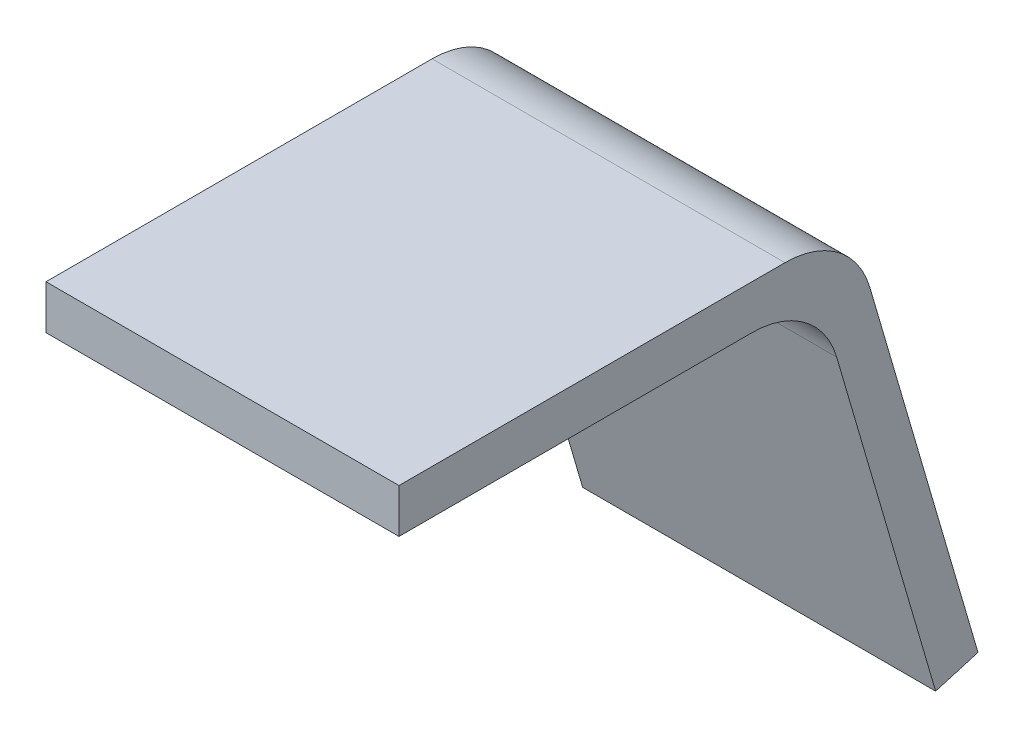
ISO-10303-21;
HEADER;
FILE_DESCRIPTION(('STEP AP214'),'2;1');
FILE_NAME('part.step','',(''),(''),'','','');
FILE_SCHEMA(('AUTOMOTIVE_DESIGN { 1 0 10303 214 1 1 1 1 }'));
ENDSEC;
DATA;
#1=APPLICATION_CONTEXT('core data for automotive mechanical design processes');
#2=APPLICATION_PROTOCOL_DEFINITION('international standard','automotive_design',2000,#1);
#3=PRODUCT_CONTEXT('',#1,'mechanical');
#4=PRODUCT('Part','Part','',(#3));
#5=PRODUCT_RELATED_PRODUCT_CATEGORY('part','',(#4));
#6=PRODUCT_DEFINITION_FORMATION('','',#4);
#7=PRODUCT_DEFINITION_CONTEXT('part definition',#1,'design');
#8=PRODUCT_DEFINITION('design','',#6,#7);
#9=PRODUCT_DEFINITION_SHAPE('','',#8);
#10=(LENGTH_UNIT() NAMED_UNIT(*) SI_UNIT(.MILLI.,.METRE.));
#11=(NAMED_UNIT(*) PLANE_ANGLE_UNIT() SI_UNIT($,.RADIAN.));
#12=(NAMED_UNIT(*) SI_UNIT($,.STERADIAN.) SOLID_ANGLE_UNIT());
#13=UNCERTAINTY_MEASURE_WITH_UNIT(LENGTH_MEASURE(1.E-05),#10,'distance_accuracy_value','');
#14=(GEOMETRIC_REPRESENTATION_CONTEXT(3) GLOBAL_UNCERTAINTY_ASSIGNED_CONTEXT((#13)) GLOBAL_UNIT_ASSIGNED_CONTEXT((#10,
#11,#12)) REPRESENTATION_CONTEXT('',''));
#15=CARTESIAN_POINT('',(0.,0.,0.));
#16=DIRECTION('',(0.,0.,1.));
#17=DIRECTION('',(1.,0.,0.));
#18=AXIS2_PLACEMENT_3D('',#15,#16,#17);
#19=CARTESIAN_POINT('',(-12.7,239.737732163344,356.042138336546));
#20=DIRECTION('',(1.,0.,0.));
#21=DIRECTION('',(0.,1.,0.));
#22=AXIS2_PLACEMENT_3D('',#19,#20,#21);
#23=PLANE('',#22);
#24=DIRECTION('',(0.,0.959872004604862,0.28043846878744));
#25=VECTOR('',#24,1.);
#26=CARTESIAN_POINT('',(-12.7,296.428648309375,262.583586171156));
#27=LINE('',#26,#25);
#28=CARTESIAN_POINT('',(-12.7,284.238273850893,259.022017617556));
#29=VERTEX_POINT('',#28);
#30=CARTESIAN_POINT('',(-12.7,308.619022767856,266.145154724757));
#31=VERTEX_POINT('',#30);
#32=EDGE_CURVE('E137',#29,#31,#27,.T.);
#33=ORIENTED_EDGE('',*,*,#32,.T.);
#34=CARTESIAN_POINT('',(-12.7,306.838238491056,272.240341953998));
#35=DIRECTION('',(1.,0.,0.));
#36=DIRECTION('',(0.,0.,-1.));
#37=AXIS2_PLACEMENT_3D('',#34,#35,#36);
#38=CIRCLE('',#37,6.35000000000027);
#39=CARTESIAN_POINT('',(-12.7,313.188238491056,272.240341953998));
#40=VERTEX_POINT('',#39);
#41=EDGE_CURVE('E27',#31,#40,#38,.T.);
#42=ORIENTED_EDGE('',*,*,#41,.T.);
#43=DIRECTION('',(0.,0.,1.));
#44=VECTOR('',#43,1.);
#45=CARTESIAN_POINT('',(-12.7,313.188238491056,284.940341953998));
#46=LINE('',#45,#44);
#47=CARTESIAN_POINT('',(-12.7,313.188238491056,297.640341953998));
#48=VERTEX_POINT('',#47);
#49=EDGE_CURVE('E118',#40,#48,#46,.T.);
#50=ORIENTED_EDGE('',*,*,#49,.T.);
#51=DIRECTION('',(0.,1.,0.));
#52=VECTOR('',#51,1.);
#53=CARTESIAN_POINT('',(-12.7,314.775738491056,297.640341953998));
#54=LINE('',#53,#52);
#55=CARTESIAN_POINT('',(-12.7,316.363238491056,297.640341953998));
#56=VERTEX_POINT('',#55);
#57=EDGE_CURVE('E121',#48,#56,#54,.T.);
#58=ORIENTED_EDGE('',*,*,#57,.T.);
#59=DIRECTION('',(0.,0.,-1.));
#60=VECTOR('',#59,1.);
#61=CARTESIAN_POINT('',(-12.7,316.363238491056,283.75028335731));
#62=LINE('',#61,#60);
#63=CARTESIAN_POINT('',(-12.7,316.363238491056,269.860224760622));
#64=VERTEX_POINT('',#63);
#65=EDGE_CURVE('E254',#56,#64,#62,.T.);
#66=ORIENTED_EDGE('',*,*,#65,.T.);
#67=CARTESIAN_POINT('',(-12.7,310.013238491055,269.860224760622));
#68=DIRECTION('',(1.,0.,0.));
#69=DIRECTION('',(0.,0.,-1.));
#70=AXIS2_PLACEMENT_3D('',#67,#68,#69);
#71=CIRCLE('',#70,6.35000000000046);
#72=CARTESIAN_POINT('',(-12.7,311.794022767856,263.765037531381));
#73=VERTEX_POINT('',#72);
#74=EDGE_CURVE('E266',#73,#64,#71,.T.);
#75=ORIENTED_EDGE('',*,*,#74,.F.);
#76=DIRECTION('',(0.,-0.959872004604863,-0.280438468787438));
#77=VECTOR('',#76,1.);
#78=CARTESIAN_POINT('',(-12.7,298.461344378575,259.869730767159));
#79=LINE('',#78,#77);
#80=CARTESIAN_POINT('',(-12.7,285.128665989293,255.974424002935));
#81=VERTEX_POINT('',#80);
#82=EDGE_CURVE('E275',#73,#81,#79,.T.);
#83=ORIENTED_EDGE('',*,*,#82,.T.);
#84=DIRECTION('',(0.,-0.280438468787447,0.95987200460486));
#85=VECTOR('',#84,1.);
#86=CARTESIAN_POINT('',(-12.7,284.683469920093,257.498220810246));
#87=LINE('',#86,#85);
#88=EDGE_CURVE('E252',#81,#29,#87,.T.);
#89=ORIENTED_EDGE('',*,*,#88,.T.);
#90=EDGE_LOOP('',(#33,#42,#50,#58,#66,#75,#83,#89));
#91=FACE_BOUND('',#90,.T.);
#92=ADVANCED_FACE('F17',(#91),#23,.F.);
#93=CARTESIAN_POINT('',(12.7,239.737732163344,356.042138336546));
#94=DIRECTION('',(1.,0.,0.));
#95=DIRECTION('',(0.,1.,0.));
#96=AXIS2_PLACEMENT_3D('',#93,#94,#95);
#97=PLANE('',#96);
#98=DIRECTION('',(0.,0.959872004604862,0.28043846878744));
#99=VECTOR('',#98,1.);
#100=CARTESIAN_POINT('',(12.7,296.428648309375,262.583586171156));
#101=LINE('',#100,#99);
#102=CARTESIAN_POINT('',(12.7,284.238273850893,259.022017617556));
#103=VERTEX_POINT('',#102);
#104=CARTESIAN_POINT('',(12.7,308.619022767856,266.145154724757));
#105=VERTEX_POINT('',#104);
#106=EDGE_CURVE('E246',#103,#105,#101,.T.);
#107=ORIENTED_EDGE('',*,*,#106,.F.);
#108=DIRECTION('',(0.,-0.280438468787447,0.95987200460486));
#109=VECTOR('',#108,1.);
#110=CARTESIAN_POINT('',(12.7,284.683469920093,257.498220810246));
#111=LINE('',#110,#109);
#112=CARTESIAN_POINT('',(12.7,285.128665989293,255.974424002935));
#113=VERTEX_POINT('',#112);
#114=EDGE_CURVE('E251',#113,#103,#111,.T.);
#115=ORIENTED_EDGE('',*,*,#114,.F.);
#116=DIRECTION('',(0.,-0.959872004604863,-0.280438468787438));
#117=VECTOR('',#116,1.);
#118=CARTESIAN_POINT('',(12.7,298.461344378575,259.869730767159));
#119=LINE('',#118,#117);
#120=CARTESIAN_POINT('',(12.7,311.794022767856,263.765037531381));
#121=VERTEX_POINT('',#120);
#122=EDGE_CURVE('E270',#121,#113,#119,.T.);
#123=ORIENTED_EDGE('',*,*,#122,.F.);
#124=CARTESIAN_POINT('',(12.7,310.013238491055,269.860224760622));
#125=DIRECTION('',(1.,0.,0.));
#126=DIRECTION('',(0.,0.,-1.));
#127=AXIS2_PLACEMENT_3D('',#124,#125,#126);
#128=CIRCLE('',#127,6.35000000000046);
#129=CARTESIAN_POINT('',(12.7,316.363238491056,269.860224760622));
#130=VERTEX_POINT('',#129);
#131=EDGE_CURVE('E258',#121,#130,#128,.T.);
#132=ORIENTED_EDGE('',*,*,#131,.T.);
#133=DIRECTION('',(0.,0.,-1.));
#134=VECTOR('',#133,1.);
#135=CARTESIAN_POINT('',(12.7,316.363238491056,283.75028335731));
#136=LINE('',#135,#134);
#137=CARTESIAN_POINT('',(12.7,316.363238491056,297.640341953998));
#138=VERTEX_POINT('',#137);
#139=EDGE_CURVE('E113',#138,#130,#136,.T.);
#140=ORIENTED_EDGE('',*,*,#139,.F.);
#141=DIRECTION('',(0.,1.,0.));
#142=VECTOR('',#141,1.);
#143=CARTESIAN_POINT('',(12.7,314.775738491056,297.640341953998));
#144=LINE('',#143,#142);
#145=CARTESIAN_POINT('',(12.7,313.188238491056,297.640341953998));
#146=VERTEX_POINT('',#145);
#147=EDGE_CURVE('E110',#146,#138,#144,.T.);
#148=ORIENTED_EDGE('',*,*,#147,.F.);
#149=DIRECTION('',(0.,0.,1.));
#150=VECTOR('',#149,1.);
#151=CARTESIAN_POINT('',(12.7,313.188238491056,284.940341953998));
#152=LINE('',#151,#150);
#153=CARTESIAN_POINT('',(12.7,313.188238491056,272.240341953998));
#154=VERTEX_POINT('',#153);
#155=EDGE_CURVE('E98',#154,#146,#152,.T.);
#156=ORIENTED_EDGE('',*,*,#155,.F.);
#157=CARTESIAN_POINT('',(12.7,306.838238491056,272.240341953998));
#158=DIRECTION('',(1.,0.,0.));
#159=DIRECTION('',(0.,0.,-1.));
#160=AXIS2_PLACEMENT_3D('',#157,#158,#159);
#161=CIRCLE('',#160,6.35000000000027);
#162=EDGE_CURVE('E11',#105,#154,#161,.T.);
#163=ORIENTED_EDGE('',*,*,#162,.F.);
#164=EDGE_LOOP('',(#107,#115,#123,#132,#140,#148,#156,#163));
#165=FACE_BOUND('',#164,.T.);
#166=ADVANCED_FACE('F19',(#165),#97,.T.);
#167=CARTESIAN_POINT('',(12.7,306.838238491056,272.240341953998));
#168=DIRECTION('',(-1.,0.,0.));
#169=DIRECTION('',(0.,0.,1.));
#170=AXIS2_PLACEMENT_3D('',#167,#168,#169);
#171=CYLINDRICAL_SURFACE('',#170,6.35000000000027);
#172=ORIENTED_EDGE('',*,*,#41,.F.);
#173=DIRECTION('',(-1.,0.,0.));
#174=VECTOR('',#173,1.);
#175=CARTESIAN_POINT('',(12.7,308.619022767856,266.145154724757));
#176=LINE('',#175,#174);
#177=EDGE_CURVE('E240',#105,#31,#176,.T.);
#178=ORIENTED_EDGE('',*,*,#177,.F.);
#179=ORIENTED_EDGE('',*,*,#162,.T.);
#180=DIRECTION('',(-1.,0.,0.));
#181=VECTOR('',#180,1.);
#182=CARTESIAN_POINT('',(12.7,313.188238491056,272.240341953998));
#183=LINE('',#182,#181);
#184=EDGE_CURVE('E105',#154,#40,#183,.T.);
#185=ORIENTED_EDGE('',*,*,#184,.T.);
#186=EDGE_LOOP('',(#172,#178,#179,#185));
#187=FACE_BOUND('',#186,.T.);
#188=ADVANCED_FACE('F139',(#187),#171,.F.);
#189=CARTESIAN_POINT('',(12.7,313.188238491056,284.940341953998));
#190=DIRECTION('',(0.,-1.,0.));
#191=DIRECTION('',(0.,0.,-1.));
#192=AXIS2_PLACEMENT_3D('',#189,#190,#191);
#193=PLANE('',#192);
#194=ORIENTED_EDGE('',*,*,#49,.F.);
#195=ORIENTED_EDGE('',*,*,#184,.F.);
#196=ORIENTED_EDGE('',*,*,#155,.T.);
#197=DIRECTION('',(-1.,0.,0.));
#198=VECTOR('',#197,1.);
#199=CARTESIAN_POINT('',(12.7,313.188238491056,297.640341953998));
#200=LINE('',#199,#198);
#201=EDGE_CURVE('E103',#146,#48,#200,.T.);
#202=ORIENTED_EDGE('',*,*,#201,.T.);
#203=EDGE_LOOP('',(#194,#195,#196,#202));
#204=FACE_BOUND('',#203,.T.);
#205=ADVANCED_FACE('F101',(#204),#193,.T.);
#206=CARTESIAN_POINT('',(12.7,314.775738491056,297.640341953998));
#207=DIRECTION('',(0.,0.,1.));
#208=DIRECTION('',(1.,0.,0.));
#209=AXIS2_PLACEMENT_3D('',#206,#207,#208);
#210=PLANE('',#209);
#211=ORIENTED_EDGE('',*,*,#57,.F.);
#212=ORIENTED_EDGE('',*,*,#201,.F.);
#213=ORIENTED_EDGE('',*,*,#147,.T.);
#214=DIRECTION('',(-1.,0.,0.));
#215=VECTOR('',#214,1.);
#216=CARTESIAN_POINT('',(12.7,316.363238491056,297.640341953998));
#217=LINE('',#216,#215);
#218=EDGE_CURVE('E257',#138,#56,#217,.T.);
#219=ORIENTED_EDGE('',*,*,#218,.T.);
#220=EDGE_LOOP('',(#211,#212,#213,#219));
#221=FACE_BOUND('',#220,.T.);
#222=ADVANCED_FACE('F120',(#221),#210,.T.);
#223=CARTESIAN_POINT('',(12.7,316.363238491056,283.75028335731));
#224=DIRECTION('',(0.,1.,0.));
#225=DIRECTION('',(1.,0.,0.));
#226=AXIS2_PLACEMENT_3D('',#223,#224,#225);
#227=PLANE('',#226);
#228=ORIENTED_EDGE('',*,*,#65,.F.);
#229=ORIENTED_EDGE('',*,*,#218,.F.);
#230=ORIENTED_EDGE('',*,*,#139,.T.);
#231=DIRECTION('',(-1.,0.,0.));
#232=VECTOR('',#231,1.);
#233=CARTESIAN_POINT('',(12.7,316.363238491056,269.860224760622));
#234=LINE('',#233,#232);
#235=EDGE_CURVE('E261',#130,#64,#234,.T.);
#236=ORIENTED_EDGE('',*,*,#235,.T.);
#237=EDGE_LOOP('',(#228,#229,#230,#236));
#238=FACE_BOUND('',#237,.T.);
#239=ADVANCED_FACE('F158',(#238),#227,.T.);
#240=CARTESIAN_POINT('',(12.7,310.013238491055,269.860224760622));
#241=DIRECTION('',(-1.,0.,0.));
#242=DIRECTION('',(0.,0.,1.));
#243=AXIS2_PLACEMENT_3D('',#240,#241,#242);
#244=CYLINDRICAL_SURFACE('',#243,6.35000000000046);
#245=ORIENTED_EDGE('',*,*,#74,.T.);
#246=ORIENTED_EDGE('',*,*,#235,.F.);
#247=ORIENTED_EDGE('',*,*,#131,.F.);
#248=DIRECTION('',(-1.,0.,0.));
#249=VECTOR('',#248,1.);
#250=CARTESIAN_POINT('',(12.7,311.794022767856,263.765037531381));
#251=LINE('',#250,#249);
#252=EDGE_CURVE('E276',#121,#73,#251,.T.);
#253=ORIENTED_EDGE('',*,*,#252,.T.);
#254=EDGE_LOOP('',(#245,#246,#247,#253));
#255=FACE_BOUND('',#254,.T.);
#256=ADVANCED_FACE('F156',(#255),#244,.T.);
#257=CARTESIAN_POINT('',(12.7,298.461344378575,259.869730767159));
#258=DIRECTION('',(0.,0.280438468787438,-0.959872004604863));
#259=DIRECTION('',(-1.,0.,0.));
#260=AXIS2_PLACEMENT_3D('',#257,#258,#259);
#261=PLANE('',#260);
#262=ORIENTED_EDGE('',*,*,#82,.F.);
#263=ORIENTED_EDGE('',*,*,#252,.F.);
#264=ORIENTED_EDGE('',*,*,#122,.T.);
#265=DIRECTION('',(-1.,0.,0.));
#266=VECTOR('',#265,1.);
#267=CARTESIAN_POINT('',(12.7,285.128665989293,255.974424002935));
#268=LINE('',#267,#266);
#269=EDGE_CURVE('E249',#113,#81,#268,.T.);
#270=ORIENTED_EDGE('',*,*,#269,.T.);
#271=EDGE_LOOP('',(#262,#263,#264,#270));
#272=FACE_BOUND('',#271,.T.);
#273=ADVANCED_FACE('F183',(#272),#261,.T.);
#274=CARTESIAN_POINT('',(12.7,284.683469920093,257.498220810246));
#275=DIRECTION('',(0.,-0.95987200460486,-0.280438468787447));
#276=DIRECTION('',(0.,0.280438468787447,-0.95987200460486));
#277=AXIS2_PLACEMENT_3D('',#274,#275,#276);
#278=PLANE('',#277);
#279=ORIENTED_EDGE('',*,*,#88,.F.);
#280=ORIENTED_EDGE('',*,*,#269,.F.);
#281=ORIENTED_EDGE('',*,*,#114,.T.);
#282=DIRECTION('',(-1.,0.,0.));
#283=VECTOR('',#282,1.);
#284=CARTESIAN_POINT('',(12.7,284.238273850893,259.022017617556));
#285=LINE('',#284,#283);
#286=EDGE_CURVE('E239',#103,#29,#285,.T.);
#287=ORIENTED_EDGE('',*,*,#286,.T.);
#288=EDGE_LOOP('',(#279,#280,#281,#287));
#289=FACE_BOUND('',#288,.T.);
#290=ADVANCED_FACE('F191',(#289),#278,.T.);
#291=CARTESIAN_POINT('',(12.7,296.428648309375,262.583586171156));
#292=DIRECTION('',(0.,-0.28043846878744,0.959872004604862));
#293=DIRECTION('',(-1.,0.,0.));
#294=AXIS2_PLACEMENT_3D('',#291,#292,#293);
#295=PLANE('',#294);
#296=ORIENTED_EDGE('',*,*,#32,.F.);
#297=ORIENTED_EDGE('',*,*,#286,.F.);
#298=ORIENTED_EDGE('',*,*,#106,.T.);
#299=ORIENTED_EDGE('',*,*,#177,.T.);
#300=EDGE_LOOP('',(#296,#297,#298,#299));
#301=FACE_BOUND('',#300,.T.);
#302=ADVANCED_FACE('F199',(#301),#295,.T.);
#303=CLOSED_SHELL('',(#92,#166,#188,#205,#222,#239,#256,#273,#290,#302));
#304=MANIFOLD_SOLID_BREP('B1',#303);
#305=ADVANCED_BREP_SHAPE_REPRESENTATION('',(#18,#304),#14);
#306=SHAPE_DEFINITION_REPRESENTATION(#9,#305);
ENDSEC;
END-ISO-10303-21;
